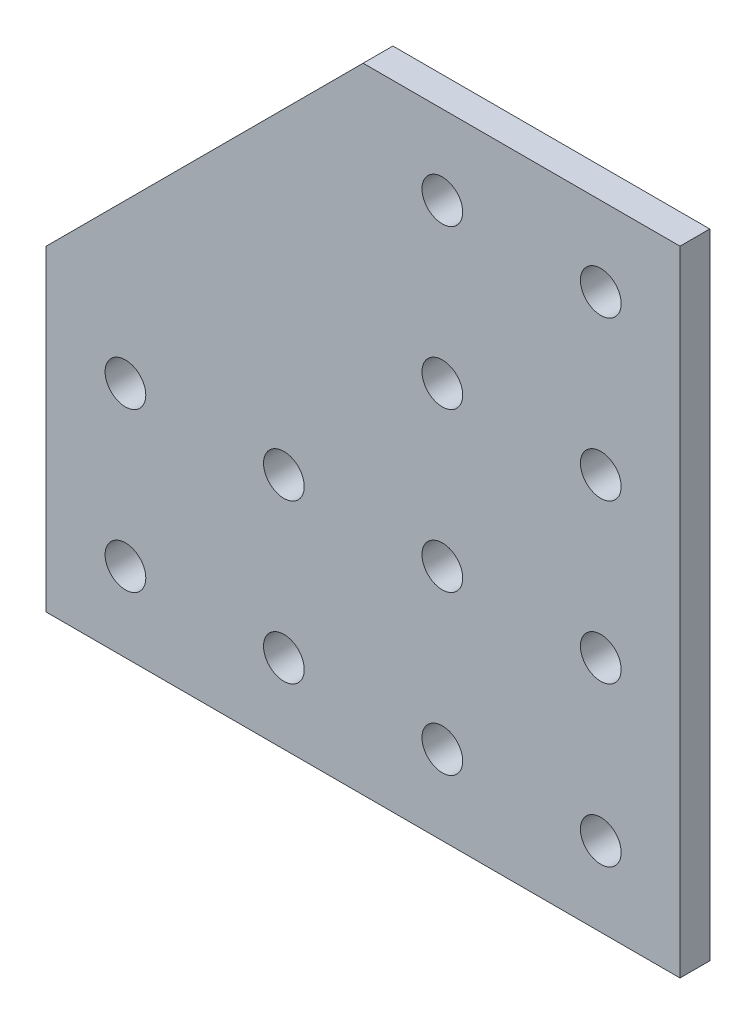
from build123d import *

# Parameters (mm, degrees)
SKETCH1_R           = 3.2639
BOSS_EXTRUDE1_DEPTH = 4.7752


with BuildPart() as part:
    # Sketch1 → Boss-Extrude1 (new body)
    with BuildSketch(Plane.XY):
        Polygon((-50.8, 0), (50.8, 0), (50.8, 101.6), (0, 101.6), (-50.8, 50.8), align=None)
        with Locations((38.1, 88.9)):
            Circle(SKETCH1_R, mode=Mode.SUBTRACT)
        with Locations((38.1, 63.5)):
            Circle(SKETCH1_R, mode=Mode.SUBTRACT)
        with Locations((38.1, 38.1)):
            Circle(SKETCH1_R, mode=Mode.SUBTRACT)
        with Locations((38.1, 12.7)):
            Circle(SKETCH1_R, mode=Mode.SUBTRACT)
        with Locations((12.7, 88.9)):
            Circle(SKETCH1_R, mode=Mode.SUBTRACT)
        with Locations((12.7, 63.5)):
            Circle(SKETCH1_R, mode=Mode.SUBTRACT)
        with Locations((12.7, 38.1)):
            Circle(SKETCH1_R, mode=Mode.SUBTRACT)
        with Locations((12.7, 12.7)):
            Circle(SKETCH1_R, mode=Mode.SUBTRACT)
        with Locations((-12.7, 38.1)):
            Circle(SKETCH1_R, mode=Mode.SUBTRACT)
        with Locations((-12.7, 12.7)):
            Circle(SKETCH1_R, mode=Mode.SUBTRACT)
        with Locations((-38.1, 38.1)):
            Circle(SKETCH1_R, mode=Mode.SUBTRACT)
        with Locations((-38.1, 12.7)):
            Circle(SKETCH1_R, mode=Mode.SUBTRACT)
    extrude(amount=BOSS_EXTRUDE1_DEPTH)


solid = part.part
